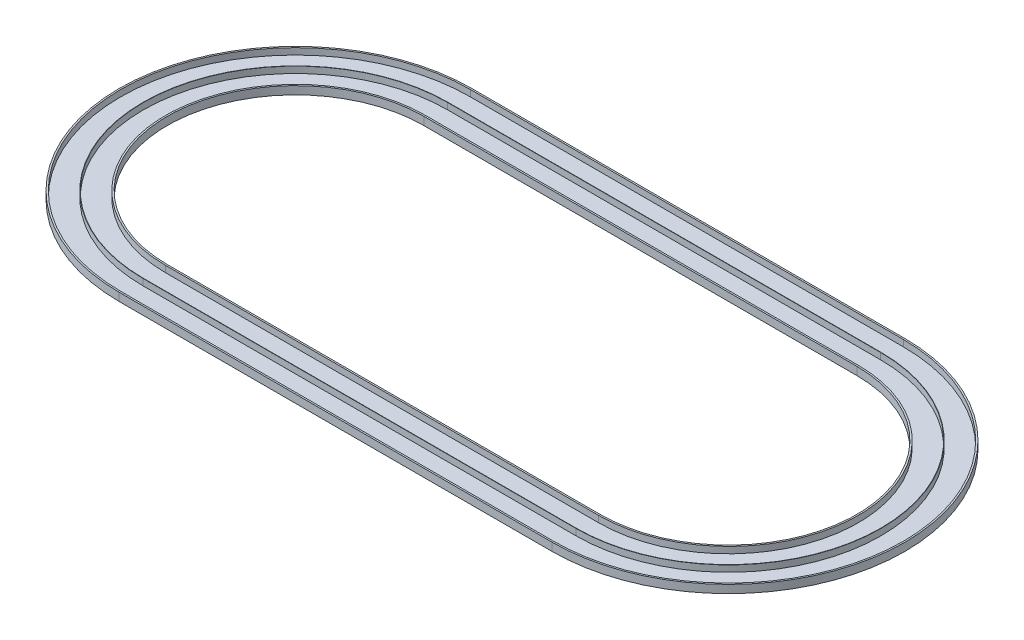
from build123d import *

# Parameters (mm, degrees)
BOSS_EXTRUDE1_DEPTH = 12.7
SHELL1_T            = -2.54
BOSS_EXTRUDE2_DEPTH = 10.16


with BuildPart() as part:
    # Sketch1 → Boss-Extrude1 (new body)
    with BuildSketch(Plane(origin=(0, 0, 0), x_dir=(1, 0, 0), z_dir=(0, 1, 0))):
        with BuildLine():
            Line((0, 279.4), (685.8, 279.4))
            ThreePointArc((685.8, 279.4), (965.2, 0), (685.8, -279.4))
            Line((685.8, -279.4), (0, -279.4))
            ThreePointArc((0, -279.4), (-279.4, 0), (0, 279.4))
        make_face()
        with BuildLine():
            Line((0, 203.2), (685.8, 203.2))
            ThreePointArc((685.8, 203.2), (889, 0), (685.8, -203.2))
            Line((685.8, -203.2), (0, -203.2))
            ThreePointArc((0, -203.2), (-203.2, 0), (0, 203.2))
        make_face(mode=Mode.SUBTRACT)
    extrude(amount=BOSS_EXTRUDE1_DEPTH)

    # Shell1
    shell1_openings = [part.faces().sort_by_distance(p)[0] for p in [
        (342.9, 12.7, -265.757102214),
    ]]
    offset(amount=SHELL1_T, openings=shell1_openings, kind=Kind.INTERSECTION)

    # Sketch2 → Boss-Extrude2 (add)
    with BuildSketch(Plane(origin=(0, 2.54, 0), x_dir=(1, 0, 0), z_dir=(0, 1, 0))):
        with BuildLine():
            Line((685.8, -241.554), (0, -241.554))
            ThreePointArc((0, -241.554), (-241.554, 0), (0, 241.554))
            Line((0, 241.554), (685.8, 241.554))
            ThreePointArc((685.8, 241.554), (927.354, 0), (685.8, -241.554))
        make_face()
        with BuildLine():
            Line((0, 241.046), (685.8, 241.046))
            ThreePointArc((685.8, 241.046), (926.846, 0), (685.8, -241.046))
            Line((685.8, -241.046), (0, -241.046))
            ThreePointArc((0, -241.046), (-241.046, 0), (0, 241.046))
        make_face(mode=Mode.SUBTRACT)
    extrude(amount=BOSS_EXTRUDE2_DEPTH)


solid = part.part
